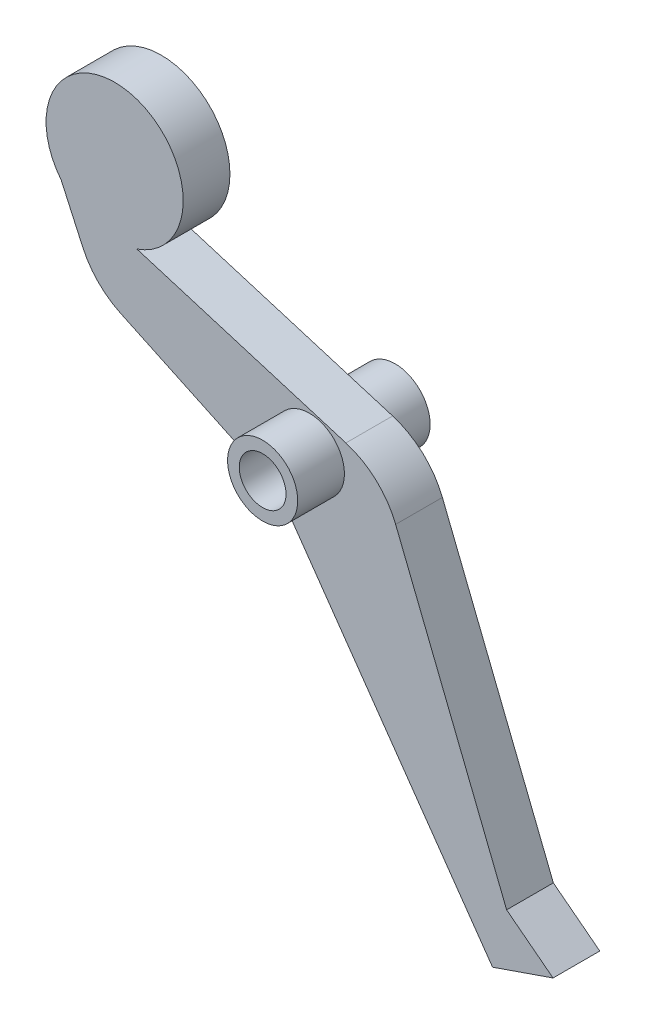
from build123d import *

# Parameters (mm, degrees)
ESQUISSE1_R      = 3
EXTRUSION1_DEPTH = 6
EXTRUSION2_START = -11
ESQUISSE2_R      = 4.5
ESQUISSE2_R_2    = 3
EXTRUSION2_DEPTH = 17


with BuildPart() as part:
    # Esquisse1 → Extrusion1 (new body)
    with BuildSketch(Plane.XY):
        with BuildLine():
            Line((120.92980641, 12.350301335), (123.704184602, 6.253893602))
            ThreePointArc((123.704184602, 6.253893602), (125.691065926, 3.369059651), (128.550947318, 1.346427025))
            Line((128.550947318, 1.346427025), (146.385172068, -7.039130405))
            ThreePointArc((146.385172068, -7.039130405), (148.570479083, -8.438738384), (150.322061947, -10.353529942))
            Line((150.322061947, -10.353529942), (176.30998456, -47.473966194))
            Line((176.30998456, -47.473966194), (184.07328656, -44.794176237))
            Line((184.07328656, -44.794176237), (178.113332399, -40.198454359))
            Line((178.113332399, -40.198454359), (163.866062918, -4.468304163))
            ThreePointArc((163.866062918, -4.468304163), (161.342314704, -0.807770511), (157.481200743, 1.396908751))
            Line((157.481200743, 1.396908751), (130.653762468, 9.538192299))
            ThreePointArc((130.653762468, 9.538192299), (130.236440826, 26.313367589), (120.92980641, 12.350301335))
        make_face()
        with Locations((152.791711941, -2.140229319)):
            Circle(ESQUISSE1_R, mode=Mode.SUBTRACT)
    extrude(amount=-EXTRUSION1_DEPTH)

    # Esquisse2 → Extrusion2 (add)
    with BuildSketch(Plane.XY.offset(EXTRUSION2_START)):
        with Locations((152.791711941, -2.140229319)):
            Circle(ESQUISSE2_R)
        with Locations((152.791711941, -2.140229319)):
            Circle(ESQUISSE2_R_2, mode=Mode.SUBTRACT)
    extrude(amount=EXTRUSION2_DEPTH)


solid = part.part
